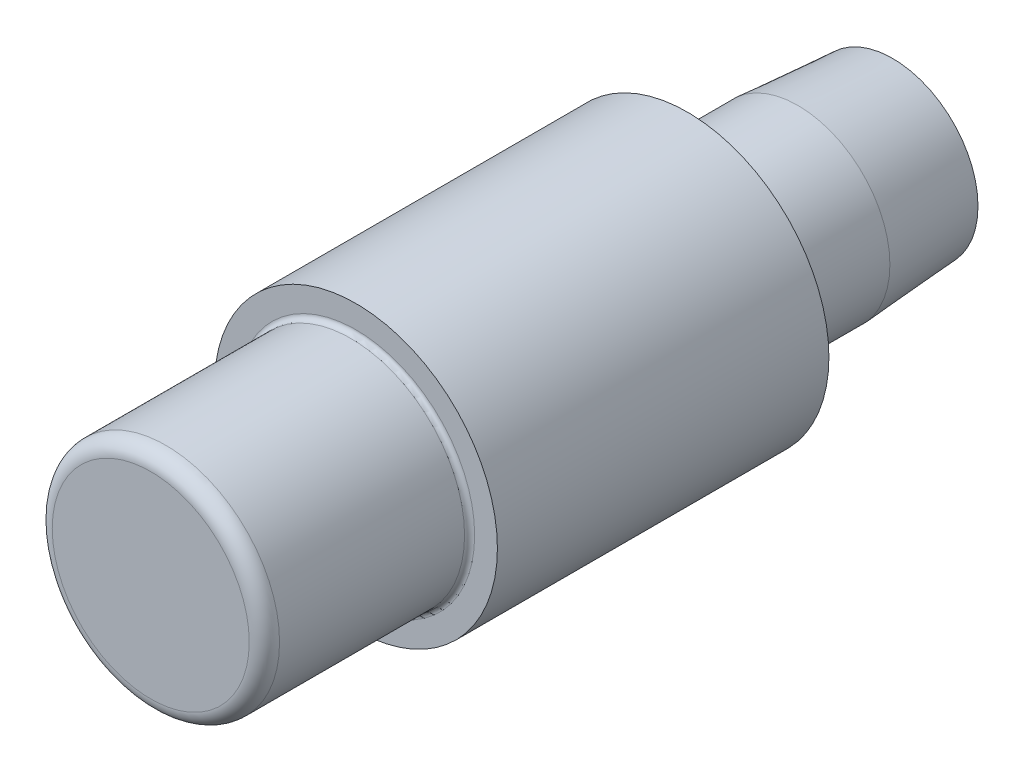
from build123d import *

# Parameters (mm, degrees)
SKETCH1_R                           = 2.3114
EXTRUDE1_DEPTH                      = 5.159375
SKETCH2_R                           = 3.556
EXTRUDE2_DEPTH                      = 8.334375
SKETCH3_R                           = 2.8575
EXTRUDE4_DEPTH                      = 5.159375
FILLET3_R                           = 0.381
CHAMFER2_SIZE                       = 2.38125
CHAMFER2_SIZE2                      = 0.166513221
FILLET4_R                           = 0.381
F_3_32_0_09375_DIAMETER_HOLE1_D     = 2.38125
F_3_32_0_09375_DIAMETER_HOLE1_DEPTH = 7.9375
F_3_32_0_09375_DIAMETER_HOLE1_TIP   = 0.715399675
CHAMFER3_SIZE                       = 0.254
FILLET5_R                           = 0.127


with BuildPart() as part:
    # Sketch1 → Extrude1 (new body)
    with BuildSketch(Plane.XY):
        Circle(SKETCH1_R)
    extrude(amount=EXTRUDE1_DEPTH)

    # Sketch2 → Extrude2 (add)
    with BuildSketch(Plane.XY.offset(5.159375)):
        Circle(SKETCH2_R)
    extrude(amount=EXTRUDE2_DEPTH)

    # Sketch3 → Extrude4 (add)
    with BuildSketch(Plane.XY.offset(13.49375)):
        Circle(SKETCH3_R)
    extrude(amount=EXTRUDE4_DEPTH)

    # Fillet3
    fillet3_edges = [part.edges().sort_by_distance(p)[0] for p in [
        (-2.8575, 0, 18.653125),
    ]]
    fillet(fillet3_edges, radius=FILLET3_R)

    # Chamfer2
    chamfer2_edges = [part.edges().sort_by_distance(p)[0] for p in [
        (-2.3114, 0, 0),
    ]]
    chamfer2_side = [part.faces().sort_by_distance(p)[0] for p in [
        (-2.3114, 0, 2.5796875),
    ]]
    chamfer(chamfer2_edges, length=CHAMFER2_SIZE, length2=CHAMFER2_SIZE2, reference=chamfer2_side[0])

    # Fillet4
    fillet4_edges = [part.edges().sort_by_distance(p)[0] for p in [
        (-2.3114, 0, 5.159375),
    ]]
    fillet(fillet4_edges, radius=FILLET4_R)

    # 3_32 _0.09375_ Diameter Hole1
    with Locations(Plane(origin=(0, 0, 0), x_dir=(-1, 0, 0), z_dir=(0, 0, -1))):
        with Locations((0, 0)):
            Hole(F_3_32_0_09375_DIAMETER_HOLE1_D / 2, depth=F_3_32_0_09375_DIAMETER_HOLE1_DEPTH)
            with Locations((0, 0, -(F_3_32_0_09375_DIAMETER_HOLE1_DEPTH + F_3_32_0_09375_DIAMETER_HOLE1_TIP / 2))):  # 118° drill point
                Cone(0, F_3_32_0_09375_DIAMETER_HOLE1_D / 2, F_3_32_0_09375_DIAMETER_HOLE1_TIP, mode=Mode.SUBTRACT)

    # Chamfer3
    chamfer3_edges = [part.edges().sort_by_distance(p)[0] for p in [
        (-1.190625, 0, 0),
    ]]
    chamfer(chamfer3_edges, length=CHAMFER3_SIZE)

    # Fillet5
    fillet5_edges = [part.edges().sort_by_distance(p)[0] for p in [
        (-2.8575, 0, 13.49375),
    ]]
    fillet(fillet5_edges, radius=FILLET5_R)


solid = part.part
